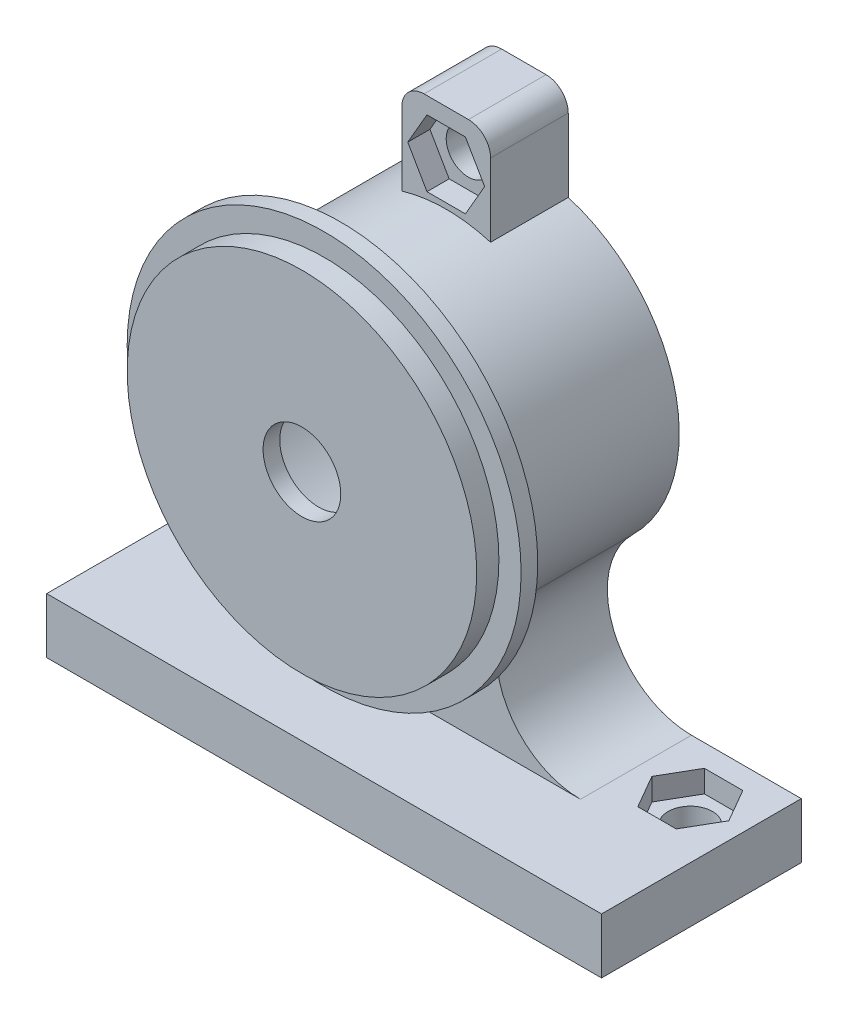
from build123d import *

# Parameters (mm, degrees)
CROQUIS1_R              = 14
SALIENTE_EXTRUIR1_DEPTH = 20
CROQUIS2_R              = 3.5
CORTAR_EXTRUIR1_DEPTH   = 20
CROQUIS3_R              = 10
CORTAR_EXTRUIR2_DEPTH   = 18.5
CROQUIS4_R              = 12.5
CORTAR_EXTRUIR3_DEPTH   = 15.5
CROQUIS5_R              = 0.75
SALIENTE_EXTRUIR2_DEPTH = 4
SALIENTE_EXTRUIR3_START = -20
SALIENTE_EXTRUIR3_DEPTH = 20
CORTAR_EXTRUIR4_START   = -10
CORTAR_EXTRUIR4_DEPTH   = 10
CROQUIS7_R              = 2
CORTAR_EXTRUIR5_DEPTH   = 39.845849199
CROQUIS9_R              = 2
SALIENTE_EXTRUIR4_DEPTH = 7
CORTAR_EXTRUIR6_DEPTH   = 5
SALIENTE_EXTRUIR6_START = -2
CROQUIS11_R             = 15.75
CROQUIS11_R_2           = 14
SALIENTE_EXTRUIR6_DEPTH = 2
SALIENTE_EXTRUIR7_START = 1.5
CROQUIS12_R             = 17.75
CROQUIS12_R_2           = 14
SALIENTE_EXTRUIR7_DEPTH = 1.5
CROQUIS10_W             = 50
CROQUIS10_H             = 5
SALIENTE_EXTRUIR5_DEPTH = 8
CROQUIS13_R             = 2
CORTAR_EXTRUIR7_DEPTH   = 56.226805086
CORTAR_EXTRUIR8_DEPTH   = 2


with BuildPart() as part:
    # Croquis1 → Saliente-Extruir1 (new body)
    with BuildSketch(Plane.XY):
        Circle(CROQUIS1_R)
    extrude(amount=SALIENTE_EXTRUIR1_DEPTH)

    # Croquis2 → Cortar-Extruir1 (cut)
    with BuildSketch(Plane.XY.offset(20)):
        Circle(CROQUIS2_R)
    extrude(amount=-CORTAR_EXTRUIR1_DEPTH, mode=Mode.SUBTRACT)

    # Croquis3 → Cortar-Extruir2 (cut)
    with BuildSketch(Plane(origin=(0, 0, 0), x_dir=(-1, 0, 0), z_dir=(0, 0, -1))):
        Circle(CROQUIS3_R)
    extrude(amount=-CORTAR_EXTRUIR2_DEPTH, mode=Mode.SUBTRACT)

    # Croquis4 → Cortar-Extruir3 (cut)
    with BuildSketch(Plane(origin=(0, 0, 0), x_dir=(-1, 0, 0), z_dir=(0, 0, -1))):
        Circle(CROQUIS4_R)
    extrude(amount=-CORTAR_EXTRUIR3_DEPTH, mode=Mode.SUBTRACT)

    # Croquis5 → Saliente-Extruir2 (add)
    with BuildSketch(Plane(origin=(0, 0, 18.5), x_dir=(-1, 0, 0), z_dir=(0, 0, -1))):
        with Locations(Location((0, -6, 0), (0, 0, 180))):
            Circle(CROQUIS5_R)
        with Locations(Location((0, 6, 0), (0, 0, 180))):
            Circle(CROQUIS5_R)
    extrude(amount=SALIENTE_EXTRUIR2_DEPTH)

    # Croquis6 → Saliente-Extruir3 (add)
    with BuildSketch(Plane.XY.offset(20).offset(SALIENTE_EXTRUIR3_START)):
        with BuildLine():
            Line((-25, -23), (-25, -28))
            Line((-25, -28), (25, -28))
            Line((25, -28), (25, -23))
            Line((25, -23), (15.105186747, -23))
            ThreePointArc((15.105186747, -23), (8.084384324, -18.282897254), (9.797958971, -10))
            ThreePointArc((9.797958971, -10), (0, -14), (-9.797958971, -10))
            ThreePointArc((-9.797958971, -10), (-8.084384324, -18.282897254), (-15.105186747, -23))
            Line((-15.105186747, -23), (-25, -23))
        make_face()
    extrude(amount=SALIENTE_EXTRUIR3_DEPTH)

    # Croquis6_3 → Cortar-Extruir4 (cut)
    with BuildSketch(Plane.XY.offset(20).offset(CORTAR_EXTRUIR4_START)):
        with BuildLine():
            Line((-25, -23), (-25, -28))
            Line((-25, -28), (25, -28))
            Line((25, -28), (25, -23))
            Line((25, -23), (15.105186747, -23))
            ThreePointArc((15.105186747, -23), (8.084384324, -18.282897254), (9.797958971, -10))
            ThreePointArc((9.797958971, -10), (0, -14), (-9.797958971, -10))
            ThreePointArc((-9.797958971, -10), (-8.084384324, -18.282897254), (-15.105186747, -23))
            Line((-15.105186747, -23), (-25, -23))
        make_face()
    extrude(amount=CORTAR_EXTRUIR4_DEPTH, mode=Mode.SUBTRACT)

    # Croquis7 → Cortar-Extruir5 (cut, through all)
    with BuildSketch(Plane.XY.offset(10)):
        with Locations((0, -18)):
            Circle(CROQUIS7_R)
    extrude(amount=-CORTAR_EXTRUIR5_DEPTH, mode=Mode.SUBTRACT)

    # Croquis9 → Saliente-Extruir4 (add)
    with BuildSketch(Plane(origin=(0, 0, 0), x_dir=(-1, 0, 0), z_dir=(0, 0, -1))):
        with BuildLine():
            Line((-4, 13.416407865), (-4, 20))
            ThreePointArc((-4, 20), (-3.414213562, 21.414213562), (-2, 22))
            Line((-2, 22), (2, 22))
            ThreePointArc((2, 22), (3.414213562, 21.414213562), (4, 20))
            Line((4, 20), (4, 13.416407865))
            ThreePointArc((4, 13.416407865), (0, 14), (-4, 13.416407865))
        make_face()
        with Locations((0, 17.5)):
            Circle(CROQUIS9_R, mode=Mode.SUBTRACT)
    extrude(amount=-SALIENTE_EXTRUIR4_DEPTH)

    # Croquis8 → Cortar-Extruir6 (cut)
    with BuildSketch(Plane.XY.offset(10)):
        Polygon((3.464101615, -18), (1.732050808, -15), (-1.732050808, -15), (-3.464101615, -18), (-1.732050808, -21), (1.732050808, -21), align=None)
        Polygon((3.464101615, 17.5), (1.732050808, 20.5), (-1.732050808, 20.5), (-3.464101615, 17.5), (-1.732050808, 14.5), (1.732050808, 14.5), align=None)
    extrude(amount=-CORTAR_EXTRUIR6_DEPTH, mode=Mode.SUBTRACT)

    # Croquis11 → Saliente-Extruir6 (add)
    with BuildSketch(Plane.XY.offset(20).offset(SALIENTE_EXTRUIR6_START)):
        Circle(CROQUIS11_R)
        with Locations(Location((0, 0, 0), (0, 0, 225.584691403))):
            Circle(CROQUIS11_R_2, mode=Mode.SUBTRACT)
    extrude(amount=SALIENTE_EXTRUIR6_DEPTH)

    # Croquis12 → Saliente-Extruir7 (add)
    with BuildSketch(Plane(origin=(0, 0, 18), x_dir=(-1, 0, 0), z_dir=(0, 0, -1)).offset(SALIENTE_EXTRUIR7_START)):
        Circle(CROQUIS12_R)
        Circle(CROQUIS12_R_2, mode=Mode.SUBTRACT)
    extrude(amount=-SALIENTE_EXTRUIR7_DEPTH)

    # Croquis10 → Saliente-Extruir5 (add)
    with BuildSketch(Plane.XY.offset(10)):
        with Locations((0, -25.5)):
            Rectangle(CROQUIS10_W, CROQUIS10_H)
    extrude(amount=SALIENTE_EXTRUIR5_DEPTH)

    # Croquis13 → Cortar-Extruir7 (cut, through all)
    with BuildSketch(Plane(origin=(0, -23, 0), x_dir=(1, 0, 0), z_dir=(0, 1, 0))):
        with Locations(Location((20, -5, 0), (0, 0, 180))):
            Circle(CROQUIS13_R)
        with Locations(Location((-20, -5, 0), (0, 0, 180))):
            Circle(CROQUIS13_R)
    extrude(amount=-CORTAR_EXTRUIR7_DEPTH, mode=Mode.SUBTRACT)

    # Croquis14 → Cortar-Extruir8 (cut)
    with BuildSketch(Plane(origin=(0, -23, 0), x_dir=(1, 0, 0), z_dir=(0, 1, 0))):
        Polygon((-16.535898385, -5), (-18.267949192, -2), (-21.732050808, -2), (-23.464101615, -5), (-21.732050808, -8), (-18.267949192, -8), align=None)
        Polygon((23.464101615, -5), (21.732050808, -2), (18.267949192, -2), (16.535898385, -5), (18.267949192, -8), (21.732050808, -8), align=None)
    extrude(amount=-CORTAR_EXTRUIR8_DEPTH, mode=Mode.SUBTRACT)


solid = part.part
